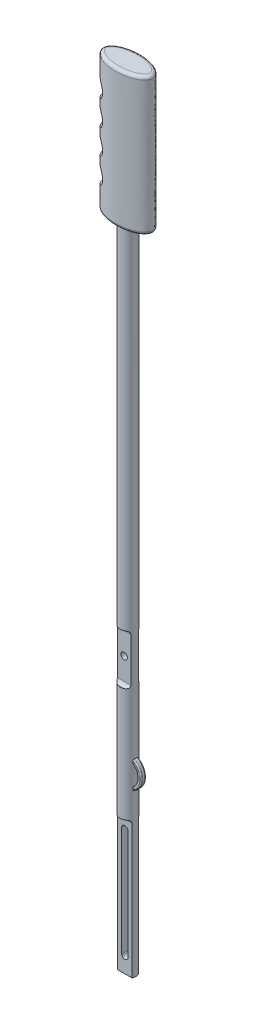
from build123d import *

# Parameters (mm, degrees)
EXTRUDE1_DEPTH      = 635
EXTRUDE1_DEPTH_BACK = 25.4
SKETCH1_R           = 7.9375
CUT_EXTRUDE1_DEPTH  = 12.7
SKETCH3_R           = 3.302
CUT_EXTRUDE2_DEPTH  = 12.7
CUT_EXTRUDE3_DEPTH  = 12.7
CUT_EXTRUDE4_DEPTH  = 12.7
SKETCH9_RX          = 25.4
SKETCH9_RY          = 12.7
EXTRUDE2_DEPTH      = 139.7
SKETCH8_R           = 9.525
CUT_EXTRUDE6_DEPTH  = 111.379
FILLET1_R           = 3.175
EXTRUDE3_DEPTH      = 2.54
EXTRUDE3_DEPTH_BACK = 2.54
FILLET2_R           = 1.27


with BuildPart() as part:
    # Sketch1 → Extrude1 (new, two sides: drawn at the far end of the back side and taken through both)
    with BuildSketch(Plane(origin=(0, 0, 0), x_dir=(1, 0, 0), z_dir=(0, 1, 0)).offset(-EXTRUDE1_DEPTH_BACK)):
        with Locations(Location((0, 0, 0), (0, 0, 270))):
            Circle(SKETCH1_R)
    extrude(amount=EXTRUDE1_DEPTH + EXTRUDE1_DEPTH_BACK)

    # Sketch2 → Cut-Extrude1 (cut, symmetric)
    with BuildSketch(Plane(origin=(0, 0, 0), x_dir=(0, 0, -1), z_dir=(1, 0, 0))):
        with BuildLine():
            Line((-7.14375, 279.4), (-7.9375, 279.4))
            Line((-7.9375, 279.4), (-7.9375, 228.6))
            Line((-7.9375, 228.6), (-7.14375, 228.6))
            ThreePointArc((-7.14375, 228.6), (-4.89868597, 229.52993597), (-3.96875, 231.775))
            Line((-3.96875, 231.775), (-3.96875, 276.225))
            ThreePointArc((-3.96875, 276.225), (-4.89868597, 278.47006403), (-7.14375, 279.4))
        make_face()
        with BuildLine():
            Line((7.14375, 279.4), (7.9375, 279.4))
            Line((7.9375, 279.4), (7.9375, 228.6))
            Line((7.9375, 228.6), (7.14375, 228.6))
            ThreePointArc((7.14375, 228.6), (4.89868597, 229.52993597), (3.96875, 231.775))
            Line((3.96875, 231.775), (3.96875, 276.225))
            ThreePointArc((3.96875, 276.225), (4.89868597, 278.47006403), (7.14375, 279.4))
        make_face()
    extrude(amount=CUT_EXTRUDE1_DEPTH, both=True, mode=Mode.SUBTRACT)

    # Sketch3 → Cut-Extrude2 (cut, symmetric)
    with BuildSketch(Plane.XY):
        with Locations((0, 254)):
            Circle(SKETCH3_R)
    extrude(amount=CUT_EXTRUDE2_DEPTH, both=True, mode=Mode.SUBTRACT)

    # Sketch4 → Cut-Extrude3 (cut, symmetric)
    with BuildSketch(Plane(origin=(0, 0, 0), x_dir=(0, 0, -1), z_dir=(1, 0, 0))):
        with BuildLine():
            Line((-7.9375, -25.52395964), (-3.163812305, -25.52395964))
            Line((-3.163812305, -25.52395964), (-3.223299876, 110.192861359))
            ThreePointArc((-3.223299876, 110.192861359), (-4.153235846, 112.437925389), (-6.398299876, 113.367861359))
            Line((-6.398299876, 113.367861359), (-7.9375, 113.367861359))
            Line((-7.9375, 113.367861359), (-7.9375, -25.52395964))
        make_face()
        with BuildLine():
            Line((7.9375, -25.676511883), (3.175, -25.676511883))
            Line((3.175, -25.676511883), (3.175, 110.192861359))
            ThreePointArc((3.175, 110.192861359), (4.10493597, 112.437925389), (6.35, 113.367861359))
            Line((6.35, 113.367861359), (7.9375, 113.367861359))
            Line((7.9375, 113.367861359), (7.9375, -25.676511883))
        make_face()
    extrude(amount=CUT_EXTRUDE3_DEPTH, both=True, mode=Mode.SUBTRACT)

    # Sketch5 → Cut-Extrude4 (cut, symmetric)
    with BuildSketch(Plane.XY):
        with BuildLine():
            Line((3.175000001, 101.600000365), (3.175012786, -9.525))
            ThreePointArc((3.175012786, -9.525), (1.2786e-05, -12.7), (-3.174987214, -9.525))
            Line((-3.174987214, -9.525), (-3.174999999, 101.599999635))
            ThreePointArc((-3.174999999, 101.599999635), (-3.65e-07, 104.775), (3.175000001, 101.600000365))
        make_face()
    extrude(amount=CUT_EXTRUDE4_DEPTH, both=True, mode=Mode.SUBTRACT)

    # Sketch9 → Extrude2 (add)
    with BuildSketch(Plane(origin=(0, 635, 0), x_dir=(1, 0, 0), z_dir=(0, 1, 0))):
        with Locations(Location((0, 0), (0, 0, 180))):
            Ellipse(SKETCH9_RX, SKETCH9_RY)
    extrude(amount=EXTRUDE2_DEPTH)

    # Sketch8 → Cut-Extrude6 (cut, symmetric)
    with BuildSketch(Plane.XY):
        with Locations((-25.4, 742.95)):
            Circle(SKETCH8_R)
        with Locations((-25.4, 717.55)):
            Circle(SKETCH8_R)
        with Locations((-25.4, 692.15)):
            Circle(SKETCH8_R)
        with Locations((-25.4, 666.75)):
            Circle(SKETCH8_R)
    extrude(amount=CUT_EXTRUDE6_DEPTH, both=True, mode=Mode.SUBTRACT)

    # Fillet1
    fillet1_edges = [part.edges().sort_by_distance(p)[0] for p in [
        (25.39948603, 635, -0.080792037),
        (25.39948603, 774.7, -0.080792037),
    ]]
    fillet(fillet1_edges, radius=FILLET1_R)

    # Sketch10 → Extrude3 (add, two sides: drawn at the far end of the back side and taken through both)
    with BuildSketch(Plane.XY.offset(-EXTRUDE3_DEPTH_BACK)):
        with BuildLine():
            Line((0.080871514, 165.099742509), (0.080871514, 168.274794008))
            ThreePointArc((0.080871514, 168.274794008), (15.875, 152.4), (0.080871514, 136.525205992))
            Line((0.080871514, 136.525205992), (0.080871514, 139.700257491))
            ThreePointArc((0.080871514, 139.700257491), (12.7, 152.4), (0.080871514, 165.099742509))
        make_face()
    extrude(amount=EXTRUDE3_DEPTH + EXTRUDE3_DEPTH_BACK)

    # Fillet2
    fillet2_edges = [part.edges().sort_by_distance(p)[0] for p in [
        (15.875, 152.4, -2.54),
        (15.875, 152.4, 2.54),
    ]]
    fillet(fillet2_edges, radius=FILLET2_R)


solid = part.part
